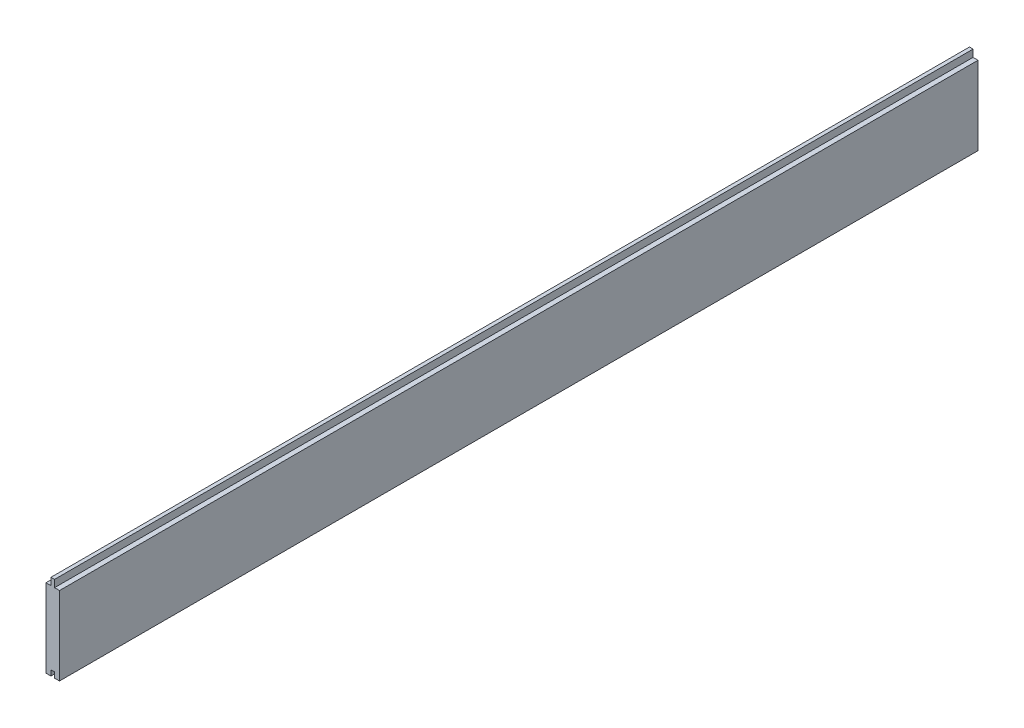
from build123d import *

# Parameters (mm, degrees)
ESQUISSE1_W        = 4
ESQUISSE1_H        = 8
BOSS_EXTRU_1_DEPTH = 1020


with BuildPart() as part:
    # Esquisse1 → Boss.-Extru.1 (new body)
    with BuildSketch(Plane.XY):
        with Locations((0, 47.5)):
            Rectangle(ESQUISSE1_W, ESQUISSE1_H)
        with Locations((0, 39.5)):
            Rectangle(ESQUISSE1_W, ESQUISSE1_H)
        Polygon((-2, 43.5), (-7.5, 43.5), (-7.5, -43.5), (-2, -43.5), (-2, -37.5), (2, -37.5), (2, -43.5), (7.5, -43.5), (7.5, 43.5), (2, 43.5), (2, 35.5), (-2, 35.5), align=None)
    extrude(amount=BOSS_EXTRU_1_DEPTH)


solid = part.part
